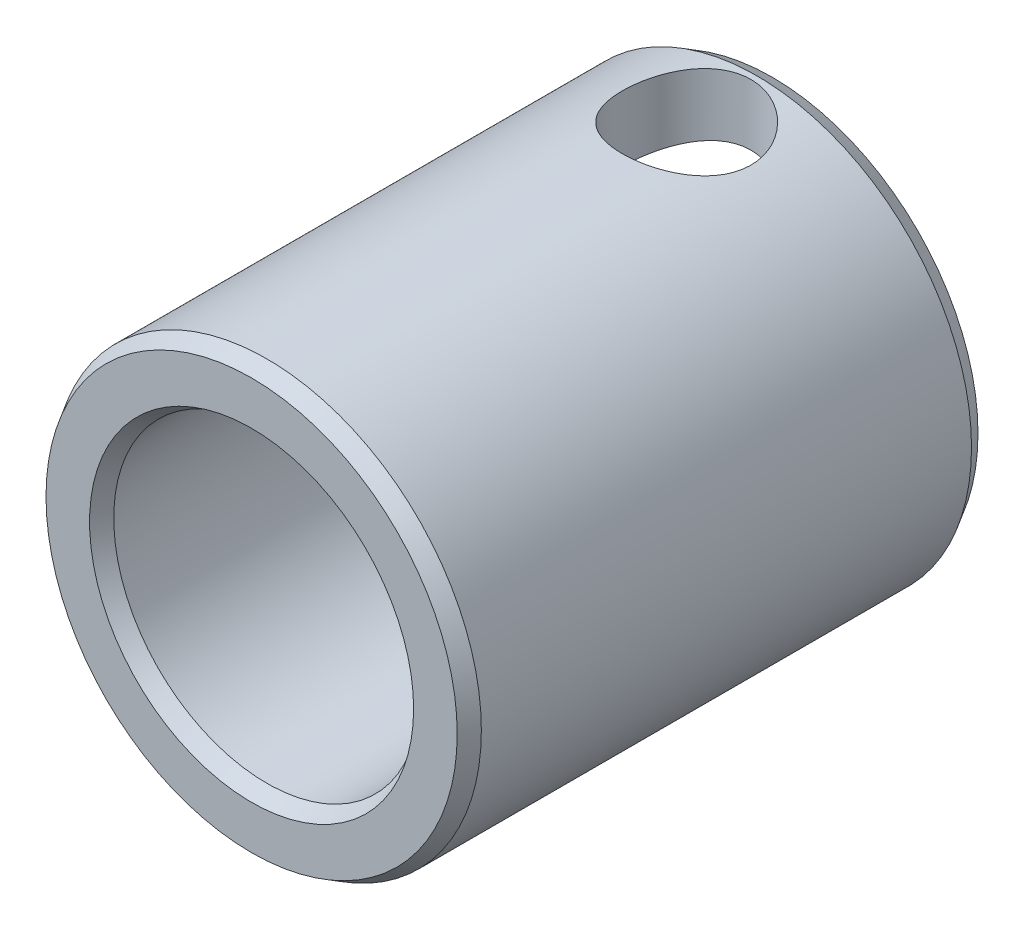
ISO-10303-21;
HEADER;
FILE_DESCRIPTION(('STEP AP214'),'2;1');
FILE_NAME('part.step','',(''),(''),'','','');
FILE_SCHEMA(('AUTOMOTIVE_DESIGN { 1 0 10303 214 1 1 1 1 }'));
ENDSEC;
DATA;
#1=APPLICATION_CONTEXT('core data for automotive mechanical design processes');
#2=APPLICATION_PROTOCOL_DEFINITION('international standard','automotive_design',2000,#1);
#3=PRODUCT_CONTEXT('',#1,'mechanical');
#4=PRODUCT('Part','Part','',(#3));
#5=PRODUCT_RELATED_PRODUCT_CATEGORY('part','',(#4));
#6=PRODUCT_DEFINITION_FORMATION('','',#4);
#7=PRODUCT_DEFINITION_CONTEXT('part definition',#1,'design');
#8=PRODUCT_DEFINITION('design','',#6,#7);
#9=PRODUCT_DEFINITION_SHAPE('','',#8);
#10=(LENGTH_UNIT() NAMED_UNIT(*) SI_UNIT(.MILLI.,.METRE.));
#11=(NAMED_UNIT(*) PLANE_ANGLE_UNIT() SI_UNIT($,.RADIAN.));
#12=(NAMED_UNIT(*) SI_UNIT($,.STERADIAN.) SOLID_ANGLE_UNIT());
#13=UNCERTAINTY_MEASURE_WITH_UNIT(LENGTH_MEASURE(1.E-05),#10,'distance_accuracy_value','');
#14=(GEOMETRIC_REPRESENTATION_CONTEXT(3) GLOBAL_UNCERTAINTY_ASSIGNED_CONTEXT((#13)) GLOBAL_UNIT_ASSIGNED_CONTEXT((#10,
#11,#12)) REPRESENTATION_CONTEXT('',''));
#15=CARTESIAN_POINT('',(0.,0.,0.));
#16=DIRECTION('',(0.,0.,1.));
#17=DIRECTION('',(1.,0.,0.));
#18=AXIS2_PLACEMENT_3D('',#15,#16,#17);
#19=CARTESIAN_POINT('',(0.,0.,19.9000287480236));
#20=DIRECTION('',(0.,0.,1.));
#21=DIRECTION('',(1.,0.,0.));
#22=AXIS2_PLACEMENT_3D('',#19,#20,#21);
#23=CYLINDRICAL_SURFACE('',#22,5.);
#24=CARTESIAN_POINT('',(0.,0.,16.5));
#25=DIRECTION('',(0.,0.,1.));
#26=DIRECTION('',(1.,0.,0.));
#27=AXIS2_PLACEMENT_3D('',#24,#25,#26);
#28=CIRCLE('',#27,5.);
#29=CARTESIAN_POINT('',(5.,0.,16.5));
#30=VERTEX_POINT('',#29);
#31=EDGE_CURVE('E29',#30,#30,#28,.T.);
#32=ORIENTED_EDGE('',*,*,#31,.T.);
#33=EDGE_LOOP('',(#32));
#34=FACE_BOUND('',#33,.T.);
#35=CARTESIAN_POINT('',(0.,0.,0.5));
#36=DIRECTION('',(0.,0.,1.));
#37=DIRECTION('',(1.,0.,0.));
#38=AXIS2_PLACEMENT_3D('',#35,#36,#37);
#39=CIRCLE('',#38,5.);
#40=CARTESIAN_POINT('',(5.,0.,0.5));
#41=VERTEX_POINT('',#40);
#42=EDGE_CURVE('E25',#41,#41,#39,.T.);
#43=ORIENTED_EDGE('',*,*,#42,.F.);
#44=EDGE_LOOP('',(#43));
#45=FACE_BOUND('',#44,.T.);
#46=CARTESIAN_POINT('',(0.,5.,4.9));
#47=CARTESIAN_POINT('',(-0.112421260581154,4.99999333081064,4.8999912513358));
#48=CARTESIAN_POINT('',(-0.225000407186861,4.99616592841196,4.89092141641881));
#49=CARTESIAN_POINT('',(-0.446972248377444,4.98123118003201,4.85497450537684));
#50=CARTESIAN_POINT('',(-0.55635593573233,4.97010500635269,4.82805137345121));
#51=CARTESIAN_POINT('',(-0.76835039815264,4.94176430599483,4.75756693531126));
#52=CARTESIAN_POINT('',(-0.87098288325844,4.92457055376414,4.71406236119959));
#53=CARTESIAN_POINT('',(-1.06739278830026,4.8857658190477,4.61188714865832));
#54=CARTESIAN_POINT('',(-1.16117280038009,4.86415613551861,4.55322096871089));
#55=CARTESIAN_POINT('',(-1.3421338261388,4.81744880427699,4.41923837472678));
#56=CARTESIAN_POINT('',(-1.42880573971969,4.79223574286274,4.34327496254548));
#57=CARTESIAN_POINT('',(-1.58861874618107,4.74165902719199,4.17822285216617));
#58=CARTESIAN_POINT('',(-1.66175260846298,4.71629529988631,4.0891271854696));
#59=CARTESIAN_POINT('',(-1.79604183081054,4.66686358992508,3.89492195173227));
#60=CARTESIAN_POINT('',(-1.85641196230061,4.64292449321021,3.789233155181));
#61=CARTESIAN_POINT('',(-1.9582903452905,4.60088674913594,3.56805063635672));
#62=CARTESIAN_POINT('',(-1.99980846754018,4.58278504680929,3.45256208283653));
#63=CARTESIAN_POINT('',(-2.06069339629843,4.55572282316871,3.22091862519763));
#64=CARTESIAN_POINT('',(-2.08104088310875,4.54635990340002,3.10507032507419));
#65=CARTESIAN_POINT('',(-2.10206556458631,4.53668036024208,2.87125462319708));
#66=CARTESIAN_POINT('',(-2.10275385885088,4.53635863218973,2.75328845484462));
#67=CARTESIAN_POINT('',(-2.08517838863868,4.54445782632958,2.52842726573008));
#68=CARTESIAN_POINT('',(-2.06839112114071,4.55219766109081,2.42138734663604));
#69=CARTESIAN_POINT('',(-2.01882069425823,4.57439532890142,2.21181403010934));
#70=CARTESIAN_POINT('',(-1.98603441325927,4.58885447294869,2.10928151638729));
#71=CARTESIAN_POINT('',(-1.90475526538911,4.62318960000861,1.90902281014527));
#72=CARTESIAN_POINT('',(-1.8559407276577,4.64317507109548,1.81144679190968));
#73=CARTESIAN_POINT('',(-1.74421855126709,4.6862864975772,1.62548751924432));
#74=CARTESIAN_POINT('',(-1.68130530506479,4.70941370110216,1.53710794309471));
#75=CARTESIAN_POINT('',(-1.53682141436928,4.7586218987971,1.36405042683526));
#76=CARTESIAN_POINT('',(-1.4541115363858,4.78478586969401,1.28034449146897));
#77=CARTESIAN_POINT('',(-1.27557303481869,4.83544396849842,1.12766206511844));
#78=CARTESIAN_POINT('',(-1.17974124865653,4.85993769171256,1.05868913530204));
#79=CARTESIAN_POINT('',(-0.974684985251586,4.90522758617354,0.935973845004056));
#80=CARTESIAN_POINT('',(-0.865196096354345,4.92592190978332,0.882632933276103));
#81=CARTESIAN_POINT('',(-0.637707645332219,4.96049707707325,0.795469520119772));
#82=CARTESIAN_POINT('',(-0.519712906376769,4.97438174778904,0.761636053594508));
#83=CARTESIAN_POINT('',(-0.286679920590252,4.99305470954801,0.716496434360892));
#84=CARTESIAN_POINT('',(-0.171936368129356,4.9983686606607,0.70388621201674));
#85=CARTESIAN_POINT('',(0.0581412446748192,5.00098385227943,0.697655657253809));
#86=CARTESIAN_POINT('',(0.173475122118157,4.99828744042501,0.704029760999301));
#87=CARTESIAN_POINT('',(0.395312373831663,4.98552504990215,0.734658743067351));
#88=CARTESIAN_POINT('',(0.501967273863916,4.9758388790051,0.757992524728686));
#89=CARTESIAN_POINT('',(0.709728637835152,4.95047932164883,0.820590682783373));
#90=CARTESIAN_POINT('',(0.810834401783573,4.93480518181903,0.85985706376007));
#91=CARTESIAN_POINT('',(1.00818189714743,4.8983626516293,0.954486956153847));
#92=CARTESIAN_POINT('',(1.10417428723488,4.87745088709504,1.01031345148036));
#93=CARTESIAN_POINT('',(1.2857730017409,4.83275775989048,1.13597087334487));
#94=CARTESIAN_POINT('',(1.37137493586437,4.80897519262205,1.20580768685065));
#95=CARTESIAN_POINT('',(1.53629380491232,4.75896603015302,1.36342906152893));
#96=CARTESIAN_POINT('',(1.61470399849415,4.73268731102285,1.45214822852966));
#97=CARTESIAN_POINT('',(1.75578239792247,4.68218504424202,1.64189457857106));
#98=CARTESIAN_POINT('',(1.81844681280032,4.65796199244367,1.74292471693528));
#99=CARTESIAN_POINT('',(1.92699302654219,4.61412955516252,1.95663233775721));
#100=CARTESIAN_POINT('',(1.97260446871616,4.59459611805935,2.06946387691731));
#101=CARTESIAN_POINT('',(2.04378702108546,4.56338397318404,2.30228555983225));
#102=CARTESIAN_POINT('',(2.06937501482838,4.55169864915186,2.42226958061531));
#103=CARTESIAN_POINT('',(2.098093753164,4.53852721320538,2.6559122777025));
#104=CARTESIAN_POINT('',(2.10281966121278,4.53631703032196,2.76933490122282));
#105=CARTESIAN_POINT('',(2.09395263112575,4.54041709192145,2.99529294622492));
#106=CARTESIAN_POINT('',(2.0803626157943,4.54672597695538,3.10782850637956));
#107=CARTESIAN_POINT('',(2.03659654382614,4.56648699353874,3.32324018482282));
#108=CARTESIAN_POINT('',(2.00724892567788,4.57958128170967,3.426320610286));
#109=CARTESIAN_POINT('',(1.93361811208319,4.61115138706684,3.62611424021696));
#110=CARTESIAN_POINT('',(1.88933070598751,4.62962872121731,3.72282564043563));
#111=CARTESIAN_POINT('',(1.78398506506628,4.67127236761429,3.91354185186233));
#112=CARTESIAN_POINT('',(1.72207244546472,4.69465512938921,4.0070265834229));
#113=CARTESIAN_POINT('',(1.5844223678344,4.74288120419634,4.18277882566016));
#114=CARTESIAN_POINT('',(1.50867999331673,4.76772503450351,4.26504232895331));
#115=CARTESIAN_POINT('',(1.33881414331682,4.81829681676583,4.42232622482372));
#116=CARTESIAN_POINT('',(1.24374163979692,4.84395273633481,4.49635035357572));
#117=CARTESIAN_POINT('',(1.04160910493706,4.89140406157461,4.62745043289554));
#118=CARTESIAN_POINT('',(0.93454365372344,4.91319771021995,4.68451867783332));
#119=CARTESIAN_POINT('',(0.712909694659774,4.95016391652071,4.77888688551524));
#120=CARTESIAN_POINT('',(0.598488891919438,4.96543696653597,4.81648893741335));
#121=CARTESIAN_POINT('',(0.423046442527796,4.98242021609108,4.8578272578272));
#122=CARTESIAN_POINT('',(0.363983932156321,4.98709206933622,4.86909260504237));
#123=CARTESIAN_POINT('',(0.244993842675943,4.99434801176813,4.88652360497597));
#124=CARTESIAN_POINT('',(0.185066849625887,4.99693345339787,4.89269256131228));
#125=CARTESIAN_POINT('',(0.083378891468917,4.99947925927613,4.89875979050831));
#126=CARTESIAN_POINT('',(0.04170030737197,5.00000247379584,4.90000324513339));
#127=CARTESIAN_POINT('',(0.,5.,4.9));
#128=B_SPLINE_CURVE_WITH_KNOTS('',3,(#46,#47,#48,#49,#50,#51,#52,#53,#54,#55,#56,#57,#58,#59,
#60,#61,#62,#63,#64,#65,#66,#67,#68,#69,#70,#71,#72,#73,#74,#75,#76,#77,#78,#79,#80,#81,#82,#83,
#84,#85,#86,#87,#88,#89,#90,#91,#92,#93,#94,#95,#96,#97,#98,#99,#100,#101,#102,#103,#104,#105,
#106,#107,#108,#109,#110,#111,#112,#113,#114,#115,#116,#117,#118,#119,#120,#121,#122,#123,#124,
#125,#126,#127),.UNSPECIFIED.,.T.,.F.,(4,2,2,2,2,2,2,2,2,2,2,2,2,2,2,2,2,2,2,2,2,2,2,2,2,2,2,2,
2,2,2,2,2,2,2,2,2,2,2,2,4),(0.,0.337117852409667,0.675108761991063,1.01195349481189,
1.34869928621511,1.70109212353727,2.05367263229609,2.42394551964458,2.79402431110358,
3.14607251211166,3.49792194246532,3.82228185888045,4.14670508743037,4.47808378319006,
4.809594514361,5.16961532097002,5.52972305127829,5.89839924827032,6.26686801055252,
6.61173647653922,6.95650388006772,7.28382587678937,7.61118906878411,7.94874145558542,
8.28643597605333,8.64863382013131,9.01091878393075,9.37872565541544,9.74622206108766,
10.0850701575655,10.4238641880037,10.7463772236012,11.0689812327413,11.4111551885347,
11.7534510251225,12.1212491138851,12.4892140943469,12.851283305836,13.0320009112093,
13.2126012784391,13.3376480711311),.UNSPECIFIED.);
#129=CARTESIAN_POINT('',(0.,5.,4.9));
#130=VERTEX_POINT('',#129);
#131=EDGE_CURVE('E49',#130,#130,#128,.T.);
#132=ORIENTED_EDGE('',*,*,#131,.F.);
#133=EDGE_LOOP('',(#132));
#134=FACE_BOUND('',#133,.T.);
#135=ADVANCED_FACE('F12',(#34,#45,#134),#23,.F.);
#136=CARTESIAN_POINT('',(0.,0.,19.9000287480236));
#137=DIRECTION('',(0.,0.,1.));
#138=DIRECTION('',(1.,0.,0.));
#139=AXIS2_PLACEMENT_3D('',#136,#137,#138);
#140=CYLINDRICAL_SURFACE('',#139,7.);
#141=CARTESIAN_POINT('',(0.,0.,16.5));
#142=DIRECTION('',(0.,0.,1.));
#143=DIRECTION('',(1.,0.,0.));
#144=AXIS2_PLACEMENT_3D('',#141,#142,#143);
#145=CIRCLE('',#144,7.);
#146=CARTESIAN_POINT('',(7.,0.,16.5));
#147=VERTEX_POINT('',#146);
#148=EDGE_CURVE('E40',#147,#147,#145,.T.);
#149=ORIENTED_EDGE('',*,*,#148,.F.);
#150=EDGE_LOOP('',(#149));
#151=FACE_BOUND('',#150,.T.);
#152=CARTESIAN_POINT('',(0.,0.,0.5));
#153=DIRECTION('',(0.,0.,1.));
#154=DIRECTION('',(1.,0.,0.));
#155=AXIS2_PLACEMENT_3D('',#152,#153,#154);
#156=CIRCLE('',#155,7.);
#157=CARTESIAN_POINT('',(7.,0.,0.5));
#158=VERTEX_POINT('',#157);
#159=EDGE_CURVE('E43',#158,#158,#156,.T.);
#160=ORIENTED_EDGE('',*,*,#159,.T.);
#161=EDGE_LOOP('',(#160));
#162=FACE_BOUND('',#161,.T.);
#163=CARTESIAN_POINT('',(0.,7.,4.9));
#164=CARTESIAN_POINT('',(0.11520405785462,6.9999990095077,4.89999860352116));
#165=CARTESIAN_POINT('',(0.230422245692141,6.99712881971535,4.89048859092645));
#166=CARTESIAN_POINT('',(0.457503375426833,6.98595947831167,4.85279010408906));
#167=CARTESIAN_POINT('',(0.569365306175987,6.97765870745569,4.82459605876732));
#168=CARTESIAN_POINT('',(0.786425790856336,6.95653773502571,4.75055557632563));
#169=CARTESIAN_POINT('',(0.891633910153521,6.94372420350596,4.70473518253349));
#170=CARTESIAN_POINT('',(1.09287385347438,6.91490952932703,4.59684946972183));
#171=CARTESIAN_POINT('',(1.18890445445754,6.89890796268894,4.53478198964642));
#172=CARTESIAN_POINT('',(1.37182051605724,6.86491032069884,4.39428638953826));
#173=CARTESIAN_POINT('',(1.45840529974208,6.84687337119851,4.31547672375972));
#174=CARTESIAN_POINT('',(1.61734889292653,6.81108167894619,4.14454707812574));
#175=CARTESIAN_POINT('',(1.68970530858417,6.79332698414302,4.05242486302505));
#176=CARTESIAN_POINT('',(1.81972052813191,6.75967759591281,3.85494094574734));
#177=CARTESIAN_POINT('',(1.87701232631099,6.74383369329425,3.74932815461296));
#178=CARTESIAN_POINT('',(1.97289952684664,6.71641068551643,3.52941504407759));
#179=CARTESIAN_POINT('',(2.01149941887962,6.70483055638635,3.41511681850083));
#180=CARTESIAN_POINT('',(2.06782287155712,6.68767219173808,3.18445362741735));
#181=CARTESIAN_POINT('',(2.08610074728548,6.68193497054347,3.06823615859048));
#182=CARTESIAN_POINT('',(2.10299222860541,6.67663905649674,2.83425358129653));
#183=CARTESIAN_POINT('',(2.1016105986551,6.677078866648,2.71648885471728));
#184=CARTESIAN_POINT('',(2.07965768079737,6.68394641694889,2.48726252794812));
#185=CARTESIAN_POINT('',(2.05978087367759,6.69015744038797,2.37572684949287));
#186=CARTESIAN_POINT('',(2.00252388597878,6.70751698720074,2.15765229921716));
#187=CARTESIAN_POINT('',(1.96514197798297,6.71866599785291,2.05111392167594));
#188=CARTESIAN_POINT('',(1.87342437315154,6.74481826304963,1.84435951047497));
#189=CARTESIAN_POINT('',(1.81886343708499,6.75987222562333,1.74425008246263));
#190=CARTESIAN_POINT('',(1.69449311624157,6.7921138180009,1.55437516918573));
#191=CARTESIAN_POINT('',(1.62468003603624,6.80930196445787,1.46461219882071));
#192=CARTESIAN_POINT('',(1.46833807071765,6.84475415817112,1.29403933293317));
#193=CARTESIAN_POINT('',(1.38123287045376,6.86303316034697,1.21375987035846));
#194=CARTESIAN_POINT('',(1.19456856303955,6.89797141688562,1.06882442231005));
#195=CARTESIAN_POINT('',(1.09500867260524,6.91463056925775,1.0041694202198));
#196=CARTESIAN_POINT('',(0.885297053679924,6.94460424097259,0.891996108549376));
#197=CARTESIAN_POINT('',(0.775078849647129,6.9578956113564,0.844595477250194));
#198=CARTESIAN_POINT('',(0.547743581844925,6.97946930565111,0.769160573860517));
#199=CARTESIAN_POINT('',(0.430628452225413,6.98775302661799,0.741120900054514));
#200=CARTESIAN_POINT('',(0.197333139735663,6.99815710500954,0.706086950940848));
#201=CARTESIAN_POINT('',(0.0812701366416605,7.00048790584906,0.698373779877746));
#202=CARTESIAN_POINT('',(-0.150499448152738,6.99934092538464,0.702196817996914));
#203=CARTESIAN_POINT('',(-0.266206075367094,6.9958639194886,0.713730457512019));
#204=CARTESIAN_POINT('',(-0.491265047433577,6.98362975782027,0.755138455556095));
#205=CARTESIAN_POINT('',(-0.600701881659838,6.9749936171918,0.784592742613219));
#206=CARTESIAN_POINT('',(-0.813056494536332,6.95344086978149,0.860500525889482));
#207=CARTESIAN_POINT('',(-0.91597348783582,6.94052374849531,0.906956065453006));
#208=CARTESIAN_POINT('',(-1.11501206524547,6.91137516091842,1.01675443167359));
#209=CARTESIAN_POINT('',(-1.21092135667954,6.89507393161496,1.08046307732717));
#210=CARTESIAN_POINT('',(-1.39093263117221,6.86102856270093,1.22251465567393));
#211=CARTESIAN_POINT('',(-1.47503164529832,6.84328406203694,1.30086125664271));
#212=CARTESIAN_POINT('',(-1.63220042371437,6.80754440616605,1.47334223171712));
#213=CARTESIAN_POINT('',(-1.70475873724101,6.78956355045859,1.56794662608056));
#214=CARTESIAN_POINT('',(-1.83300593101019,6.75607121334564,1.76837911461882));
#215=CARTESIAN_POINT('',(-1.88869525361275,6.74055966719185,1.87420691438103));
#216=CARTESIAN_POINT('',(-1.98124285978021,6.71394065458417,2.09374548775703));
#217=CARTESIAN_POINT('',(-2.01818885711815,6.70281272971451,2.20741666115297));
#218=CARTESIAN_POINT('',(-2.07230423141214,6.68628232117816,2.43976315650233));
#219=CARTESIAN_POINT('',(-2.08948038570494,6.68087787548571,2.55843674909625));
#220=CARTESIAN_POINT('',(-2.10310778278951,6.6765996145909,2.79210612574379));
#221=CARTESIAN_POINT('',(-2.10039277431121,6.67746306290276,2.90704911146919));
#222=CARTESIAN_POINT('',(-2.07630507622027,6.68499161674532,3.13475974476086));
#223=CARTESIAN_POINT('',(-2.05493313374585,6.69165648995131,3.24752747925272));
#224=CARTESIAN_POINT('',(-1.9946764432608,6.7098606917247,3.46632355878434));
#225=CARTESIAN_POINT('',(-1.95601245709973,6.72133846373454,3.57241820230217));
#226=CARTESIAN_POINT('',(-1.86244109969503,6.74786390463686,3.77669941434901));
#227=CARTESIAN_POINT('',(-1.80753061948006,6.76291225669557,3.8748844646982));
#228=CARTESIAN_POINT('',(-1.68068269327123,6.79556746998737,4.06442836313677));
#229=CARTESIAN_POINT('',(-1.60819786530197,6.81324756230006,4.15540826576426));
#230=CARTESIAN_POINT('',(-1.44924408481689,6.84881848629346,4.32418349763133));
#231=CARTESIAN_POINT('',(-1.36277150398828,6.8667093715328,4.40197539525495));
#232=CARTESIAN_POINT('',(-1.17525206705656,6.90131311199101,4.54443277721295));
#233=CARTESIAN_POINT('',(-1.07385304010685,6.91797623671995,4.60864802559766));
#234=CARTESIAN_POINT('',(-0.861197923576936,6.94764952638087,4.71902923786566));
#235=CARTESIAN_POINT('',(-0.749946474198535,6.9606613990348,4.76520364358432));
#236=CARTESIAN_POINT('',(-0.533060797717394,6.98043044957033,4.83405338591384));
#237=CARTESIAN_POINT('',(-0.428101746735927,6.98770838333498,4.85871634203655));
#238=CARTESIAN_POINT('',(-0.21543227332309,6.99749322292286,4.89168893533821));
#239=CARTESIAN_POINT('',(-0.107722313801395,7.00000092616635,4.90000130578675));
#240=CARTESIAN_POINT('',(0.,7.,4.9));
#241=B_SPLINE_CURVE_WITH_KNOTS('',3,(#163,#164,#165,#166,#167,#168,#169,#170,#171,#172,#173,
#174,#175,#176,#177,#178,#179,#180,#181,#182,#183,#184,#185,#186,#187,#188,#189,#190,#191,#192,
#193,#194,#195,#196,#197,#198,#199,#200,#201,#202,#203,#204,#205,#206,#207,#208,#209,#210,#211,
#212,#213,#214,#215,#216,#217,#218,#219,#220,#221,#222,#223,#224,#225,#226,#227,#228,#229,#230,
#231,#232,#233,#234,#235,#236,#237,#238,#239,#240),.UNSPECIFIED.,.T.,.F.,(4,2,2,2,2,2,2,2,2,2,2,
2,2,2,2,2,2,2,2,2,2,2,2,2,2,2,2,2,2,2,2,2,2,2,2,2,2,2,4),(0.,0.345216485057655,
0.690535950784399,1.03534714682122,1.38020423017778,1.73397844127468,2.08781212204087,
2.44960073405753,2.81130240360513,3.16287565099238,3.51436369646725,3.85316423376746,
4.19199821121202,4.53547397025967,4.87903304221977,5.23693945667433,5.594868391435,
5.95519465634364,6.31542034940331,6.66272333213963,7.00997994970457,7.34939445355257,
7.6888497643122,8.03615827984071,8.38355394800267,8.74356560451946,9.10356781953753,
9.46186940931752,9.82004813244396,10.1633021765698,10.5065424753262,10.8455205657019,
11.1845635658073,11.5359569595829,11.8874416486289,12.2492019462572,12.6107927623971,
12.9336436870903,13.2564406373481),.UNSPECIFIED.);
#242=CARTESIAN_POINT('',(0.,7.,4.9));
#243=VERTEX_POINT('',#242);
#244=EDGE_CURVE('E16',#243,#243,#241,.T.);
#245=ORIENTED_EDGE('',*,*,#244,.F.);
#246=EDGE_LOOP('',(#245));
#247=FACE_BOUND('',#246,.T.);
#248=ADVANCED_FACE('F67',(#151,#162,#247),#140,.T.);
#249=CARTESIAN_POINT('',(0.,-5.28867513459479,0.));
#250=DIRECTION('',(0.,0.,1.));
#251=DIRECTION('',(1.,0.,0.));
#252=AXIS2_PLACEMENT_3D('',#249,#250,#251);
#253=PLANE('',#252);
#254=CARTESIAN_POINT('',(0.,0.,0.));
#255=DIRECTION('',(0.,0.,1.));
#256=DIRECTION('',(1.,0.,0.));
#257=AXIS2_PLACEMENT_3D('',#254,#255,#256);
#258=CIRCLE('',#257,6.71132486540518);
#259=CARTESIAN_POINT('',(6.71132486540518,0.,0.));
#260=VERTEX_POINT('',#259);
#261=EDGE_CURVE('E46',#260,#260,#258,.T.);
#262=ORIENTED_EDGE('',*,*,#261,.F.);
#263=EDGE_LOOP('',(#262));
#264=FACE_BOUND('',#263,.T.);
#265=CARTESIAN_POINT('',(0.,0.,0.));
#266=DIRECTION('',(0.,0.,1.));
#267=DIRECTION('',(1.,0.,0.));
#268=AXIS2_PLACEMENT_3D('',#265,#266,#267);
#269=CIRCLE('',#268,5.28867513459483);
#270=CARTESIAN_POINT('',(5.28867513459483,0.,0.));
#271=VERTEX_POINT('',#270);
#272=EDGE_CURVE('E8',#271,#271,#269,.T.);
#273=ORIENTED_EDGE('',*,*,#272,.T.);
#274=EDGE_LOOP('',(#273));
#275=FACE_BOUND('',#274,.T.);
#276=ADVANCED_FACE('F14',(#264,#275),#253,.F.);
#277=CARTESIAN_POINT('',(0.,0.,0.));
#278=DIRECTION('',(0.,0.,-1.));
#279=DIRECTION('',(-1.,0.,0.));
#280=AXIS2_PLACEMENT_3D('',#277,#278,#279);
#281=CONICAL_SURFACE('',#280,5.28867513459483,0.523598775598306);
#282=ORIENTED_EDGE('',*,*,#42,.T.);
#283=EDGE_LOOP('',(#282));
#284=FACE_BOUND('',#283,.T.);
#285=ORIENTED_EDGE('',*,*,#272,.F.);
#286=EDGE_LOOP('',(#285));
#287=FACE_BOUND('',#286,.T.);
#288=ADVANCED_FACE('F80',(#284,#287),#281,.F.);
#289=CARTESIAN_POINT('',(0.,0.,17.));
#290=DIRECTION('',(0.,0.,1.));
#291=DIRECTION('',(1.,0.,0.));
#292=AXIS2_PLACEMENT_3D('',#289,#290,#291);
#293=CONICAL_SURFACE('',#292,5.28867513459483,0.523598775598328);
#294=ORIENTED_EDGE('',*,*,#31,.F.);
#295=EDGE_LOOP('',(#294));
#296=FACE_BOUND('',#295,.T.);
#297=CARTESIAN_POINT('',(0.,0.,17.));
#298=DIRECTION('',(0.,0.,1.));
#299=DIRECTION('',(1.,0.,0.));
#300=AXIS2_PLACEMENT_3D('',#297,#298,#299);
#301=CIRCLE('',#300,5.28867513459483);
#302=CARTESIAN_POINT('',(5.28867513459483,0.,17.));
#303=VERTEX_POINT('',#302);
#304=EDGE_CURVE('E34',#303,#303,#301,.T.);
#305=ORIENTED_EDGE('',*,*,#304,.T.);
#306=EDGE_LOOP('',(#305));
#307=FACE_BOUND('',#306,.T.);
#308=ADVANCED_FACE('F77',(#296,#307),#293,.F.);
#309=CARTESIAN_POINT('',(0.,-6.7113248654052,17.));
#310=DIRECTION('',(0.,0.,-1.));
#311=DIRECTION('',(-1.,0.,0.));
#312=AXIS2_PLACEMENT_3D('',#309,#310,#311);
#313=PLANE('',#312);
#314=ORIENTED_EDGE('',*,*,#304,.F.);
#315=EDGE_LOOP('',(#314));
#316=FACE_BOUND('',#315,.T.);
#317=CARTESIAN_POINT('',(0.,0.,17.));
#318=DIRECTION('',(0.,0.,1.));
#319=DIRECTION('',(1.,0.,0.));
#320=AXIS2_PLACEMENT_3D('',#317,#318,#319);
#321=CIRCLE('',#320,6.71132486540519);
#322=CARTESIAN_POINT('',(6.71132486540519,0.,17.));
#323=VERTEX_POINT('',#322);
#324=EDGE_CURVE('E37',#323,#323,#321,.T.);
#325=ORIENTED_EDGE('',*,*,#324,.T.);
#326=EDGE_LOOP('',(#325));
#327=FACE_BOUND('',#326,.T.);
#328=ADVANCED_FACE('F74',(#316,#327),#313,.F.);
#329=CARTESIAN_POINT('',(0.,0.,16.5));
#330=DIRECTION('',(0.,0.,-1.));
#331=DIRECTION('',(-1.,0.,0.));
#332=AXIS2_PLACEMENT_3D('',#329,#330,#331);
#333=CONICAL_SURFACE('',#332,7.,0.5235987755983);
#334=ORIENTED_EDGE('',*,*,#324,.F.);
#335=EDGE_LOOP('',(#334));
#336=FACE_BOUND('',#335,.T.);
#337=ORIENTED_EDGE('',*,*,#148,.T.);
#338=EDGE_LOOP('',(#337));
#339=FACE_BOUND('',#338,.T.);
#340=ADVANCED_FACE('F65',(#336,#339),#333,.T.);
#341=CARTESIAN_POINT('',(0.,0.,0.5));
#342=DIRECTION('',(0.,0.,1.));
#343=DIRECTION('',(1.,0.,0.));
#344=AXIS2_PLACEMENT_3D('',#341,#342,#343);
#345=CONICAL_SURFACE('',#344,7.,0.523598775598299);
#346=ORIENTED_EDGE('',*,*,#261,.T.);
#347=EDGE_LOOP('',(#346));
#348=FACE_BOUND('',#347,.T.);
#349=ORIENTED_EDGE('',*,*,#159,.F.);
#350=EDGE_LOOP('',(#349));
#351=FACE_BOUND('',#350,.T.);
#352=ADVANCED_FACE('F61',(#348,#351),#345,.T.);
#353=CARTESIAN_POINT('',(0.,10.,2.8));
#354=DIRECTION('',(0.,-1.,0.));
#355=DIRECTION('',(0.,0.,1.));
#356=AXIS2_PLACEMENT_3D('',#353,#354,#355);
#357=CYLINDRICAL_SURFACE('',#356,2.1);
#358=ORIENTED_EDGE('',*,*,#244,.T.);
#359=EDGE_LOOP('',(#358));
#360=FACE_BOUND('',#359,.T.);
#361=ORIENTED_EDGE('',*,*,#131,.T.);
#362=EDGE_LOOP('',(#361));
#363=FACE_BOUND('',#362,.T.);
#364=ADVANCED_FACE('F57',(#360,#363),#357,.F.);
#365=CLOSED_SHELL('',(#135,#248,#276,#288,#308,#328,#340,#352,#364));
#366=MANIFOLD_SOLID_BREP('B1',#365);
#367=ADVANCED_BREP_SHAPE_REPRESENTATION('',(#18,#366),#14);
#368=SHAPE_DEFINITION_REPRESENTATION(#9,#367);
ENDSEC;
END-ISO-10303-21;
